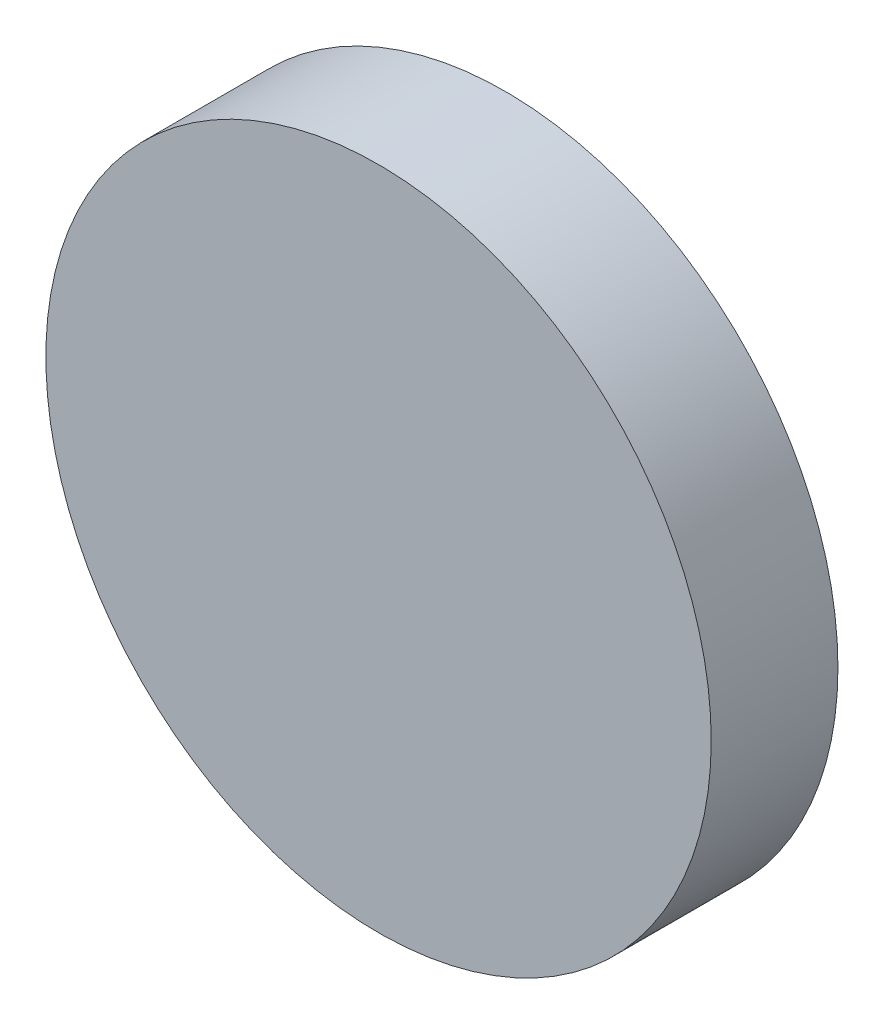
ISO-10303-21;
HEADER;
FILE_DESCRIPTION(('STEP AP214'),'2;1');
FILE_NAME('part.step','',(''),(''),'','','');
FILE_SCHEMA(('AUTOMOTIVE_DESIGN { 1 0 10303 214 1 1 1 1 }'));
ENDSEC;
DATA;
#1=APPLICATION_CONTEXT('core data for automotive mechanical design processes');
#2=APPLICATION_PROTOCOL_DEFINITION('international standard','automotive_design',2000,#1);
#3=PRODUCT_CONTEXT('',#1,'mechanical');
#4=PRODUCT('Part','Part','',(#3));
#5=PRODUCT_RELATED_PRODUCT_CATEGORY('part','',(#4));
#6=PRODUCT_DEFINITION_FORMATION('','',#4);
#7=PRODUCT_DEFINITION_CONTEXT('part definition',#1,'design');
#8=PRODUCT_DEFINITION('design','',#6,#7);
#9=PRODUCT_DEFINITION_SHAPE('','',#8);
#10=(LENGTH_UNIT() NAMED_UNIT(*) SI_UNIT(.MILLI.,.METRE.));
#11=(NAMED_UNIT(*) PLANE_ANGLE_UNIT() SI_UNIT($,.RADIAN.));
#12=(NAMED_UNIT(*) SI_UNIT($,.STERADIAN.) SOLID_ANGLE_UNIT());
#13=UNCERTAINTY_MEASURE_WITH_UNIT(LENGTH_MEASURE(1.E-05),#10,'distance_accuracy_value','');
#14=(GEOMETRIC_REPRESENTATION_CONTEXT(3) GLOBAL_UNCERTAINTY_ASSIGNED_CONTEXT((#13)) GLOBAL_UNIT_ASSIGNED_CONTEXT((#10,
#11,#12)) REPRESENTATION_CONTEXT('',''));
#15=CARTESIAN_POINT('',(0.,0.,0.));
#16=DIRECTION('',(0.,0.,1.));
#17=DIRECTION('',(1.,0.,0.));
#18=AXIS2_PLACEMENT_3D('',#15,#16,#17);
#19=CARTESIAN_POINT('',(0.,0.,20.));
#20=DIRECTION('',(0.,0.,-1.));
#21=DIRECTION('',(-1.,0.,0.));
#22=AXIS2_PLACEMENT_3D('',#19,#20,#21);
#23=CYLINDRICAL_SURFACE('',#22,52.5);
#24=CARTESIAN_POINT('',(0.,0.,20.));
#25=DIRECTION('',(0.,0.,1.));
#26=DIRECTION('',(1.,0.,0.));
#27=AXIS2_PLACEMENT_3D('',#24,#25,#26);
#28=CIRCLE('',#27,52.5);
#29=CARTESIAN_POINT('',(52.5,0.,20.));
#30=VERTEX_POINT('',#29);
#31=EDGE_CURVE('E10',#30,#30,#28,.T.);
#32=ORIENTED_EDGE('',*,*,#31,.F.);
#33=EDGE_LOOP('',(#32));
#34=FACE_BOUND('',#33,.T.);
#35=CARTESIAN_POINT('',(0.,0.,0.));
#36=DIRECTION('',(0.,0.,1.));
#37=DIRECTION('',(1.,0.,0.));
#38=AXIS2_PLACEMENT_3D('',#35,#36,#37);
#39=CIRCLE('',#38,52.5);
#40=CARTESIAN_POINT('',(52.5,0.,0.));
#41=VERTEX_POINT('',#40);
#42=EDGE_CURVE('E32',#41,#41,#39,.T.);
#43=ORIENTED_EDGE('',*,*,#42,.T.);
#44=EDGE_LOOP('',(#43));
#45=FACE_BOUND('',#44,.T.);
#46=ADVANCED_FACE('F29',(#34,#45),#23,.T.);
#47=CARTESIAN_POINT('',(0.,0.,20.));
#48=DIRECTION('',(0.,0.,1.));
#49=DIRECTION('',(1.,0.,0.));
#50=AXIS2_PLACEMENT_3D('',#47,#48,#49);
#51=PLANE('',#50);
#52=ORIENTED_EDGE('',*,*,#31,.T.);
#53=EDGE_LOOP('',(#52));
#54=FACE_BOUND('',#53,.T.);
#55=ADVANCED_FACE('F44',(#54),#51,.T.);
#56=CARTESIAN_POINT('',(0.,0.,0.));
#57=DIRECTION('',(0.,0.,1.));
#58=DIRECTION('',(1.,0.,0.));
#59=AXIS2_PLACEMENT_3D('',#56,#57,#58);
#60=PLANE('',#59);
#61=ORIENTED_EDGE('',*,*,#42,.F.);
#62=EDGE_LOOP('',(#61));
#63=FACE_BOUND('',#62,.T.);
#64=ADVANCED_FACE('F42',(#63),#60,.F.);
#65=CLOSED_SHELL('',(#46,#55,#64));
#66=MANIFOLD_SOLID_BREP('B2',#65);
#67=ADVANCED_BREP_SHAPE_REPRESENTATION('',(#18,#66),#14);
#68=SHAPE_DEFINITION_REPRESENTATION(#9,#67);
ENDSEC;
END-ISO-10303-21;
